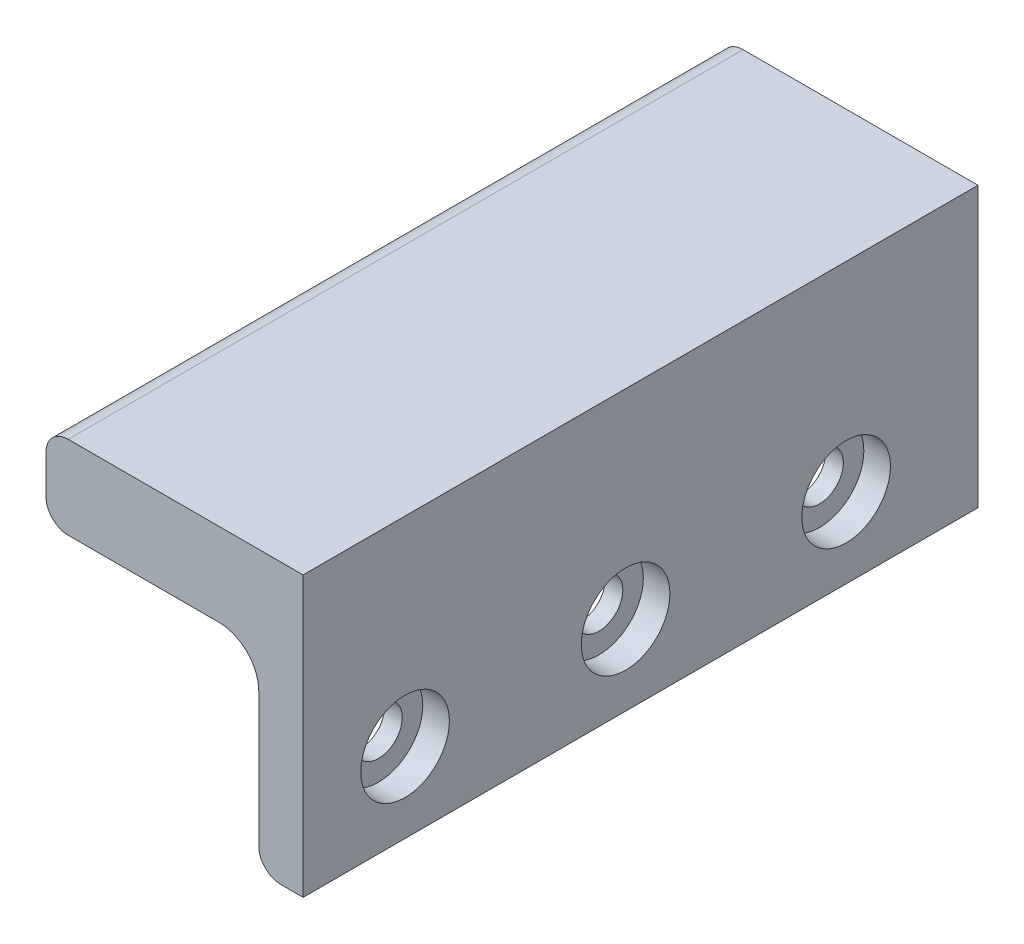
ISO-10303-21;
HEADER;
FILE_DESCRIPTION(('STEP AP214'),'2;1');
FILE_NAME('part.step','',(''),(''),'','','');
FILE_SCHEMA(('AUTOMOTIVE_DESIGN { 1 0 10303 214 1 1 1 1 }'));
ENDSEC;
DATA;
#1=APPLICATION_CONTEXT('core data for automotive mechanical design processes');
#2=APPLICATION_PROTOCOL_DEFINITION('international standard','automotive_design',2000,#1);
#3=PRODUCT_CONTEXT('',#1,'mechanical');
#4=PRODUCT('Part','Part','',(#3));
#5=PRODUCT_RELATED_PRODUCT_CATEGORY('part','',(#4));
#6=PRODUCT_DEFINITION_FORMATION('','',#4);
#7=PRODUCT_DEFINITION_CONTEXT('part definition',#1,'design');
#8=PRODUCT_DEFINITION('design','',#6,#7);
#9=PRODUCT_DEFINITION_SHAPE('','',#8);
#10=(LENGTH_UNIT() NAMED_UNIT(*) SI_UNIT(.MILLI.,.METRE.));
#11=(NAMED_UNIT(*) PLANE_ANGLE_UNIT() SI_UNIT($,.RADIAN.));
#12=(NAMED_UNIT(*) SI_UNIT($,.STERADIAN.) SOLID_ANGLE_UNIT());
#13=UNCERTAINTY_MEASURE_WITH_UNIT(LENGTH_MEASURE(1.E-05),#10,'distance_accuracy_value','');
#14=(GEOMETRIC_REPRESENTATION_CONTEXT(3) GLOBAL_UNCERTAINTY_ASSIGNED_CONTEXT((#13)) GLOBAL_UNIT_ASSIGNED_CONTEXT((#10,
#11,#12)) REPRESENTATION_CONTEXT('',''));
#15=CARTESIAN_POINT('',(0.,0.,0.));
#16=DIRECTION('',(0.,0.,1.));
#17=DIRECTION('',(1.,0.,0.));
#18=AXIS2_PLACEMENT_3D('',#15,#16,#17);
#19=CARTESIAN_POINT('',(15.6,-11.1,-60.9));
#20=DIRECTION('',(0.,0.,1.));
#21=DIRECTION('',(1.,0.,0.));
#22=AXIS2_PLACEMENT_3D('',#19,#20,#21);
#23=CYLINDRICAL_SURFACE('',#22,3.6);
#24=DIRECTION('',(0.,0.,-1.));
#25=VECTOR('',#24,1.);
#26=CARTESIAN_POINT('',(19.2,-11.1,-60.9));
#27=LINE('',#26,#25);
#28=CARTESIAN_POINT('',(19.2,-11.1,0.));
#29=VERTEX_POINT('',#28);
#30=CARTESIAN_POINT('',(19.2,-11.1,-60.9));
#31=VERTEX_POINT('',#30);
#32=EDGE_CURVE('E225',#29,#31,#27,.T.);
#33=ORIENTED_EDGE('',*,*,#32,.F.);
#34=CARTESIAN_POINT('',(15.6,-11.1,0.));
#35=DIRECTION('',(0.,0.,1.));
#36=DIRECTION('',(1.,0.,0.));
#37=AXIS2_PLACEMENT_3D('',#34,#35,#36);
#38=CIRCLE('',#37,3.6);
#39=CARTESIAN_POINT('',(15.6,-7.49999999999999,0.));
#40=VERTEX_POINT('',#39);
#41=EDGE_CURVE('E33',#29,#40,#38,.T.);
#42=ORIENTED_EDGE('',*,*,#41,.T.);
#43=DIRECTION('',(0.,0.,-1.));
#44=VECTOR('',#43,1.);
#45=CARTESIAN_POINT('',(15.6,-7.49999999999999,-60.9));
#46=LINE('',#45,#44);
#47=CARTESIAN_POINT('',(15.6,-7.49999999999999,-60.9));
#48=VERTEX_POINT('',#47);
#49=EDGE_CURVE('E228',#48,#40,#46,.F.);
#50=ORIENTED_EDGE('',*,*,#49,.F.);
#51=CARTESIAN_POINT('',(15.6,-11.1,-60.9));
#52=DIRECTION('',(0.,0.,1.));
#53=DIRECTION('',(1.,0.,0.));
#54=AXIS2_PLACEMENT_3D('',#51,#52,#53);
#55=CIRCLE('',#54,3.6);
#56=EDGE_CURVE('E11',#48,#31,#55,.F.);
#57=ORIENTED_EDGE('',*,*,#56,.T.);
#58=EDGE_LOOP('',(#33,#42,#50,#57));
#59=FACE_BOUND('',#58,.T.);
#60=ADVANCED_FACE('F26',(#59),#23,.F.);
#61=CARTESIAN_POINT('',(0.,0.,-60.9));
#62=DIRECTION('',(-1.,0.,0.));
#63=DIRECTION('',(0.,-1.,0.));
#64=AXIS2_PLACEMENT_3D('',#61,#62,#63);
#65=PLANE('',#64);
#66=DIRECTION('',(0.,-1.,0.));
#67=VECTOR('',#66,1.);
#68=CARTESIAN_POINT('',(0.,0.,0.));
#69=LINE('',#68,#67);
#70=CARTESIAN_POINT('',(0.,-2.,0.));
#71=VERTEX_POINT('',#70);
#72=CARTESIAN_POINT('',(0.,-5.5,0.));
#73=VERTEX_POINT('',#72);
#74=EDGE_CURVE('E154',#71,#73,#69,.T.);
#75=ORIENTED_EDGE('',*,*,#74,.F.);
#76=DIRECTION('',(0.,0.,1.));
#77=VECTOR('',#76,1.);
#78=CARTESIAN_POINT('',(0.,-2.,-60.9));
#79=LINE('',#78,#77);
#80=CARTESIAN_POINT('',(0.,-2.,-60.9));
#81=VERTEX_POINT('',#80);
#82=EDGE_CURVE('E209',#71,#81,#79,.F.);
#83=ORIENTED_EDGE('',*,*,#82,.T.);
#84=DIRECTION('',(0.,-1.,0.));
#85=VECTOR('',#84,1.);
#86=CARTESIAN_POINT('',(0.,0.,-60.9));
#87=LINE('',#86,#85);
#88=CARTESIAN_POINT('',(0.,-5.5,-60.9));
#89=VERTEX_POINT('',#88);
#90=EDGE_CURVE('E170',#81,#89,#87,.T.);
#91=ORIENTED_EDGE('',*,*,#90,.T.);
#92=DIRECTION('',(0.,0.,1.));
#93=VECTOR('',#92,1.);
#94=CARTESIAN_POINT('',(0.,-5.5,-60.9));
#95=LINE('',#94,#93);
#96=EDGE_CURVE('E206',#89,#73,#95,.T.);
#97=ORIENTED_EDGE('',*,*,#96,.T.);
#98=EDGE_LOOP('',(#75,#83,#91,#97));
#99=FACE_BOUND('',#98,.T.);
#100=ADVANCED_FACE('F241',(#99),#65,.T.);
#101=CARTESIAN_POINT('',(0.,0.,-60.9));
#102=DIRECTION('',(0.,1.,0.));
#103=DIRECTION('',(-1.,0.,0.));
#104=AXIS2_PLACEMENT_3D('',#101,#102,#103);
#105=PLANE('',#104);
#106=DIRECTION('',(-1.,0.,0.));
#107=VECTOR('',#106,1.);
#108=CARTESIAN_POINT('',(0.,0.,-60.9));
#109=LINE('',#108,#107);
#110=CARTESIAN_POINT('',(23.2,0.,-60.9));
#111=VERTEX_POINT('',#110);
#112=CARTESIAN_POINT('',(2.,0.,-60.9));
#113=VERTEX_POINT('',#112);
#114=EDGE_CURVE('E183',#111,#113,#109,.T.);
#115=ORIENTED_EDGE('',*,*,#114,.T.);
#116=DIRECTION('',(0.,0.,1.));
#117=VECTOR('',#116,1.);
#118=CARTESIAN_POINT('',(2.,0.,-60.9));
#119=LINE('',#118,#117);
#120=CARTESIAN_POINT('',(2.,0.,0.));
#121=VERTEX_POINT('',#120);
#122=EDGE_CURVE('E189',#113,#121,#119,.T.);
#123=ORIENTED_EDGE('',*,*,#122,.T.);
#124=DIRECTION('',(-1.,0.,0.));
#125=VECTOR('',#124,1.);
#126=CARTESIAN_POINT('',(0.,0.,0.));
#127=LINE('',#126,#125);
#128=CARTESIAN_POINT('',(23.2,0.,0.));
#129=VERTEX_POINT('',#128);
#130=EDGE_CURVE('E167',#129,#121,#127,.T.);
#131=ORIENTED_EDGE('',*,*,#130,.F.);
#132=DIRECTION('',(0.,0.,1.));
#133=VECTOR('',#132,1.);
#134=CARTESIAN_POINT('',(23.2,0.,-60.9));
#135=LINE('',#134,#133);
#136=EDGE_CURVE('E187',#111,#129,#135,.T.);
#137=ORIENTED_EDGE('',*,*,#136,.F.);
#138=EDGE_LOOP('',(#115,#123,#131,#137));
#139=FACE_BOUND('',#138,.T.);
#140=ADVANCED_FACE('F252',(#139),#105,.T.);
#141=CARTESIAN_POINT('',(23.2,0.,-60.9));
#142=DIRECTION('',(1.,0.,0.));
#143=DIRECTION('',(0.,1.,0.));
#144=AXIS2_PLACEMENT_3D('',#141,#142,#143);
#145=PLANE('',#144);
#146=CARTESIAN_POINT('',(23.2,-18.,-9.2));
#147=DIRECTION('',(1.,0.,0.));
#148=DIRECTION('',(0.,0.,-1.));
#149=AXIS2_PLACEMENT_3D('',#146,#147,#148);
#150=CIRCLE('',#149,4.);
#151=CARTESIAN_POINT('',(23.2,-18.,-13.2));
#152=VERTEX_POINT('',#151);
#153=EDGE_CURVE('E124',#152,#152,#150,.T.);
#154=ORIENTED_EDGE('',*,*,#153,.F.);
#155=EDGE_LOOP('',(#154));
#156=FACE_BOUND('',#155,.T.);
#157=CARTESIAN_POINT('',(23.2,-18.,-29.1));
#158=DIRECTION('',(1.,0.,0.));
#159=DIRECTION('',(0.,0.,-1.));
#160=AXIS2_PLACEMENT_3D('',#157,#158,#159);
#161=CIRCLE('',#160,4.);
#162=CARTESIAN_POINT('',(23.2,-18.,-33.1));
#163=VERTEX_POINT('',#162);
#164=EDGE_CURVE('E134',#163,#163,#161,.T.);
#165=ORIENTED_EDGE('',*,*,#164,.F.);
#166=EDGE_LOOP('',(#165));
#167=FACE_BOUND('',#166,.T.);
#168=CARTESIAN_POINT('',(23.2,-18.,-49.));
#169=DIRECTION('',(1.,0.,0.));
#170=DIRECTION('',(0.,0.,-1.));
#171=AXIS2_PLACEMENT_3D('',#168,#169,#170);
#172=CIRCLE('',#171,4.);
#173=CARTESIAN_POINT('',(23.2,-18.,-53.));
#174=VERTEX_POINT('',#173);
#175=EDGE_CURVE('E144',#174,#174,#172,.T.);
#176=ORIENTED_EDGE('',*,*,#175,.F.);
#177=EDGE_LOOP('',(#176));
#178=FACE_BOUND('',#177,.T.);
#179=DIRECTION('',(0.,1.,0.));
#180=VECTOR('',#179,1.);
#181=CARTESIAN_POINT('',(23.2,0.,0.));
#182=LINE('',#181,#180);
#183=CARTESIAN_POINT('',(23.2,-25.2,0.));
#184=VERTEX_POINT('',#183);
#185=EDGE_CURVE('E164',#184,#129,#182,.T.);
#186=ORIENTED_EDGE('',*,*,#185,.F.);
#187=DIRECTION('',(0.,0.,1.));
#188=VECTOR('',#187,1.);
#189=CARTESIAN_POINT('',(23.2,-25.2,-60.9));
#190=LINE('',#189,#188);
#191=CARTESIAN_POINT('',(23.2,-25.2,-60.9));
#192=VERTEX_POINT('',#191);
#193=EDGE_CURVE('E186',#192,#184,#190,.T.);
#194=ORIENTED_EDGE('',*,*,#193,.F.);
#195=DIRECTION('',(0.,1.,0.));
#196=VECTOR('',#195,1.);
#197=CARTESIAN_POINT('',(23.2,0.,-60.9));
#198=LINE('',#197,#196);
#199=EDGE_CURVE('E180',#192,#111,#198,.T.);
#200=ORIENTED_EDGE('',*,*,#199,.T.);
#201=ORIENTED_EDGE('',*,*,#136,.T.);
#202=EDGE_LOOP('',(#186,#194,#200,#201));
#203=FACE_BOUND('',#202,.T.);
#204=ADVANCED_FACE('F257',(#156,#167,#178,#203),#145,.T.);
#205=CARTESIAN_POINT('',(19.2,-25.2,-60.9));
#206=DIRECTION('',(0.,-1.,0.));
#207=DIRECTION('',(1.,0.,0.));
#208=AXIS2_PLACEMENT_3D('',#205,#206,#207);
#209=PLANE('',#208);
#210=DIRECTION('',(1.,0.,0.));
#211=VECTOR('',#210,1.);
#212=CARTESIAN_POINT('',(19.2,-25.2,0.));
#213=LINE('',#212,#211);
#214=CARTESIAN_POINT('',(21.2,-25.2,0.));
#215=VERTEX_POINT('',#214);
#216=EDGE_CURVE('E162',#215,#184,#213,.T.);
#217=ORIENTED_EDGE('',*,*,#216,.F.);
#218=DIRECTION('',(0.,0.,1.));
#219=VECTOR('',#218,1.);
#220=CARTESIAN_POINT('',(21.2,-25.2,-60.9));
#221=LINE('',#220,#219);
#222=CARTESIAN_POINT('',(21.2,-25.2,-60.9));
#223=VERTEX_POINT('',#222);
#224=EDGE_CURVE('E223',#215,#223,#221,.F.);
#225=ORIENTED_EDGE('',*,*,#224,.T.);
#226=DIRECTION('',(1.,0.,0.));
#227=VECTOR('',#226,1.);
#228=CARTESIAN_POINT('',(19.2,-25.2,-60.9));
#229=LINE('',#228,#227);
#230=EDGE_CURVE('E178',#223,#192,#229,.T.);
#231=ORIENTED_EDGE('',*,*,#230,.T.);
#232=ORIENTED_EDGE('',*,*,#193,.T.);
#233=EDGE_LOOP('',(#217,#225,#231,#232));
#234=FACE_BOUND('',#233,.T.);
#235=ADVANCED_FACE('F286',(#234),#209,.T.);
#236=CARTESIAN_POINT('',(19.2,-7.49999999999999,-60.9));
#237=DIRECTION('',(-1.,0.,0.));
#238=DIRECTION('',(0.,-1.,0.));
#239=AXIS2_PLACEMENT_3D('',#236,#237,#238);
#240=PLANE('',#239);
#241=CARTESIAN_POINT('',(19.2,-18.,-9.2));
#242=DIRECTION('',(-1.,0.,0.));
#243=DIRECTION('',(0.,-1.,0.));
#244=AXIS2_PLACEMENT_3D('',#241,#242,#243);
#245=CIRCLE('',#244,2.15);
#246=CARTESIAN_POINT('',(19.2,-20.15,-9.2));
#247=VERTEX_POINT('',#246);
#248=EDGE_CURVE('E133',#247,#247,#245,.T.);
#249=ORIENTED_EDGE('',*,*,#248,.F.);
#250=EDGE_LOOP('',(#249));
#251=FACE_BOUND('',#250,.T.);
#252=CARTESIAN_POINT('',(19.2,-18.,-29.1));
#253=DIRECTION('',(-1.,0.,0.));
#254=DIRECTION('',(0.,-1.,0.));
#255=AXIS2_PLACEMENT_3D('',#252,#253,#254);
#256=CIRCLE('',#255,2.15);
#257=CARTESIAN_POINT('',(19.2,-20.15,-29.1));
#258=VERTEX_POINT('',#257);
#259=EDGE_CURVE('E143',#258,#258,#256,.T.);
#260=ORIENTED_EDGE('',*,*,#259,.F.);
#261=EDGE_LOOP('',(#260));
#262=FACE_BOUND('',#261,.T.);
#263=CARTESIAN_POINT('',(19.2,-18.,-49.));
#264=DIRECTION('',(-1.,0.,0.));
#265=DIRECTION('',(0.,-1.,0.));
#266=AXIS2_PLACEMENT_3D('',#263,#264,#265);
#267=CIRCLE('',#266,2.15);
#268=CARTESIAN_POINT('',(19.2,-20.15,-49.));
#269=VERTEX_POINT('',#268);
#270=EDGE_CURVE('E153',#269,#269,#267,.T.);
#271=ORIENTED_EDGE('',*,*,#270,.F.);
#272=EDGE_LOOP('',(#271));
#273=FACE_BOUND('',#272,.T.);
#274=DIRECTION('',(0.,-1.,0.));
#275=VECTOR('',#274,1.);
#276=CARTESIAN_POINT('',(19.2,-7.49999999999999,0.));
#277=LINE('',#276,#275);
#278=CARTESIAN_POINT('',(19.2,-23.2,0.));
#279=VERTEX_POINT('',#278);
#280=EDGE_CURVE('E160',#29,#279,#277,.T.);
#281=ORIENTED_EDGE('',*,*,#280,.F.);
#282=ORIENTED_EDGE('',*,*,#32,.T.);
#283=DIRECTION('',(0.,-1.,0.));
#284=VECTOR('',#283,1.);
#285=CARTESIAN_POINT('',(19.2,-7.49999999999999,-60.9));
#286=LINE('',#285,#284);
#287=CARTESIAN_POINT('',(19.2,-23.2,-60.9));
#288=VERTEX_POINT('',#287);
#289=EDGE_CURVE('E176',#31,#288,#286,.T.);
#290=ORIENTED_EDGE('',*,*,#289,.T.);
#291=DIRECTION('',(0.,0.,1.));
#292=VECTOR('',#291,1.);
#293=CARTESIAN_POINT('',(19.2,-23.2,-60.9));
#294=LINE('',#293,#292);
#295=EDGE_CURVE('E220',#288,#279,#294,.T.);
#296=ORIENTED_EDGE('',*,*,#295,.T.);
#297=EDGE_LOOP('',(#281,#282,#290,#296));
#298=FACE_BOUND('',#297,.T.);
#299=ADVANCED_FACE('F269',(#251,#262,#273,#298),#240,.T.);
#300=CARTESIAN_POINT('',(0.,-7.5,-60.9));
#301=DIRECTION('',(0.,-1.,0.));
#302=DIRECTION('',(1.,0.,0.));
#303=AXIS2_PLACEMENT_3D('',#300,#301,#302);
#304=PLANE('',#303);
#305=CARTESIAN_POINT('',(10.,-7.5,-45.9));
#306=DIRECTION('',(0.,-1.,0.));
#307=DIRECTION('',(0.,0.,-1.));
#308=AXIS2_PLACEMENT_3D('',#305,#306,#307);
#309=CIRCLE('',#308,2.5);
#310=CARTESIAN_POINT('',(10.,-7.5,-48.4));
#311=VERTEX_POINT('',#310);
#312=EDGE_CURVE('E113',#311,#311,#309,.T.);
#313=ORIENTED_EDGE('',*,*,#312,.F.);
#314=EDGE_LOOP('',(#313));
#315=FACE_BOUND('',#314,.T.);
#316=CARTESIAN_POINT('',(10.,-7.5,-19.9));
#317=DIRECTION('',(0.,-1.,0.));
#318=DIRECTION('',(0.,0.,-1.));
#319=AXIS2_PLACEMENT_3D('',#316,#317,#318);
#320=CIRCLE('',#319,2.5);
#321=CARTESIAN_POINT('',(10.,-7.5,-22.4));
#322=VERTEX_POINT('',#321);
#323=EDGE_CURVE('E121',#322,#322,#320,.T.);
#324=ORIENTED_EDGE('',*,*,#323,.F.);
#325=EDGE_LOOP('',(#324));
#326=FACE_BOUND('',#325,.T.);
#327=DIRECTION('',(1.,0.,0.));
#328=VECTOR('',#327,1.);
#329=CARTESIAN_POINT('',(0.,-7.5,-60.9));
#330=LINE('',#329,#328);
#331=CARTESIAN_POINT('',(2.,-7.5,-60.9));
#332=VERTEX_POINT('',#331);
#333=EDGE_CURVE('E173',#332,#48,#330,.T.);
#334=ORIENTED_EDGE('',*,*,#333,.T.);
#335=ORIENTED_EDGE('',*,*,#49,.T.);
#336=DIRECTION('',(1.,0.,0.));
#337=VECTOR('',#336,1.);
#338=CARTESIAN_POINT('',(0.,-7.5,0.));
#339=LINE('',#338,#337);
#340=CARTESIAN_POINT('',(2.,-7.5,0.));
#341=VERTEX_POINT('',#340);
#342=EDGE_CURVE('E157',#341,#40,#339,.T.);
#343=ORIENTED_EDGE('',*,*,#342,.F.);
#344=DIRECTION('',(0.,0.,1.));
#345=VECTOR('',#344,1.);
#346=CARTESIAN_POINT('',(2.,-7.5,-60.9));
#347=LINE('',#346,#345);
#348=EDGE_CURVE('E218',#341,#332,#347,.F.);
#349=ORIENTED_EDGE('',*,*,#348,.T.);
#350=EDGE_LOOP('',(#334,#335,#343,#349));
#351=FACE_BOUND('',#350,.T.);
#352=ADVANCED_FACE('F231',(#315,#326,#351),#304,.T.);
#353=CARTESIAN_POINT('',(0.,0.,-60.9));
#354=DIRECTION('',(0.,0.,1.));
#355=DIRECTION('',(1.,0.,0.));
#356=AXIS2_PLACEMENT_3D('',#353,#354,#355);
#357=PLANE('',#356);
#358=ORIENTED_EDGE('',*,*,#90,.F.);
#359=CARTESIAN_POINT('',(2.,-2.,-60.9));
#360=DIRECTION('',(0.,0.,1.));
#361=DIRECTION('',(1.,0.,0.));
#362=AXIS2_PLACEMENT_3D('',#359,#360,#361);
#363=CIRCLE('',#362,2.);
#364=EDGE_CURVE('E216',#81,#113,#363,.F.);
#365=ORIENTED_EDGE('',*,*,#364,.T.);
#366=ORIENTED_EDGE('',*,*,#114,.F.);
#367=ORIENTED_EDGE('',*,*,#199,.F.);
#368=ORIENTED_EDGE('',*,*,#230,.F.);
#369=CARTESIAN_POINT('',(21.2,-23.2,-60.9));
#370=DIRECTION('',(0.,0.,1.));
#371=DIRECTION('',(1.,0.,0.));
#372=AXIS2_PLACEMENT_3D('',#369,#370,#371);
#373=CIRCLE('',#372,2.);
#374=EDGE_CURVE('E211',#223,#288,#373,.F.);
#375=ORIENTED_EDGE('',*,*,#374,.T.);
#376=ORIENTED_EDGE('',*,*,#289,.F.);
#377=ORIENTED_EDGE('',*,*,#56,.F.);
#378=ORIENTED_EDGE('',*,*,#333,.F.);
#379=CARTESIAN_POINT('',(2.,-5.5,-60.9));
#380=DIRECTION('',(0.,0.,1.));
#381=DIRECTION('',(1.,0.,0.));
#382=AXIS2_PLACEMENT_3D('',#379,#380,#381);
#383=CIRCLE('',#382,2.);
#384=EDGE_CURVE('E214',#332,#89,#383,.F.);
#385=ORIENTED_EDGE('',*,*,#384,.T.);
#386=EDGE_LOOP('',(#358,#365,#366,#367,#368,#375,#376,#377,#378,#385));
#387=FACE_BOUND('',#386,.T.);
#388=ADVANCED_FACE('F245',(#387),#357,.F.);
#389=CARTESIAN_POINT('',(0.,0.,0.));
#390=DIRECTION('',(0.,0.,1.));
#391=DIRECTION('',(1.,0.,0.));
#392=AXIS2_PLACEMENT_3D('',#389,#390,#391);
#393=PLANE('',#392);
#394=ORIENTED_EDGE('',*,*,#41,.F.);
#395=ORIENTED_EDGE('',*,*,#280,.T.);
#396=CARTESIAN_POINT('',(21.2,-23.2,0.));
#397=DIRECTION('',(0.,0.,1.));
#398=DIRECTION('',(1.,0.,0.));
#399=AXIS2_PLACEMENT_3D('',#396,#397,#398);
#400=CIRCLE('',#399,2.);
#401=EDGE_CURVE('E200',#279,#215,#400,.T.);
#402=ORIENTED_EDGE('',*,*,#401,.T.);
#403=ORIENTED_EDGE('',*,*,#216,.T.);
#404=ORIENTED_EDGE('',*,*,#185,.T.);
#405=ORIENTED_EDGE('',*,*,#130,.T.);
#406=CARTESIAN_POINT('',(2.,-2.,0.));
#407=DIRECTION('',(0.,0.,1.));
#408=DIRECTION('',(1.,0.,0.));
#409=AXIS2_PLACEMENT_3D('',#406,#407,#408);
#410=CIRCLE('',#409,2.);
#411=EDGE_CURVE('E204',#121,#71,#410,.T.);
#412=ORIENTED_EDGE('',*,*,#411,.T.);
#413=ORIENTED_EDGE('',*,*,#74,.T.);
#414=CARTESIAN_POINT('',(2.,-5.5,0.));
#415=DIRECTION('',(0.,0.,1.));
#416=DIRECTION('',(1.,0.,0.));
#417=AXIS2_PLACEMENT_3D('',#414,#415,#416);
#418=CIRCLE('',#417,2.);
#419=EDGE_CURVE('E202',#73,#341,#418,.T.);
#420=ORIENTED_EDGE('',*,*,#419,.T.);
#421=ORIENTED_EDGE('',*,*,#342,.T.);
#422=EDGE_LOOP('',(#394,#395,#402,#403,#404,#405,#412,#413,#420,#421));
#423=FACE_BOUND('',#422,.T.);
#424=ADVANCED_FACE('F234',(#423),#393,.T.);
#425=CARTESIAN_POINT('',(23.2,-18.,-49.));
#426=DIRECTION('',(1.,0.,0.));
#427=DIRECTION('',(0.,0.,-1.));
#428=AXIS2_PLACEMENT_3D('',#425,#426,#427);
#429=CYLINDRICAL_SURFACE('',#428,2.15);
#430=ORIENTED_EDGE('',*,*,#270,.T.);
#431=EDGE_LOOP('',(#430));
#432=FACE_BOUND('',#431,.T.);
#433=CARTESIAN_POINT('',(20.8,-18.,-49.));
#434=DIRECTION('',(1.,0.,0.));
#435=DIRECTION('',(0.,0.,-1.));
#436=AXIS2_PLACEMENT_3D('',#433,#434,#435);
#437=CIRCLE('',#436,2.15);
#438=CARTESIAN_POINT('',(20.8,-18.,-51.15));
#439=VERTEX_POINT('',#438);
#440=EDGE_CURVE('E150',#439,#439,#437,.T.);
#441=ORIENTED_EDGE('',*,*,#440,.T.);
#442=EDGE_LOOP('',(#441));
#443=FACE_BOUND('',#442,.T.);
#444=ADVANCED_FACE('F297',(#432,#443),#429,.F.);
#445=CARTESIAN_POINT('',(20.8,-15.85,-49.));
#446=DIRECTION('',(-1.,0.,0.));
#447=DIRECTION('',(0.,0.,1.));
#448=AXIS2_PLACEMENT_3D('',#445,#446,#447);
#449=PLANE('',#448);
#450=ORIENTED_EDGE('',*,*,#440,.F.);
#451=EDGE_LOOP('',(#450));
#452=FACE_BOUND('',#451,.T.);
#453=CARTESIAN_POINT('',(20.8,-18.,-49.));
#454=DIRECTION('',(1.,0.,0.));
#455=DIRECTION('',(0.,0.,-1.));
#456=AXIS2_PLACEMENT_3D('',#453,#454,#455);
#457=CIRCLE('',#456,4.);
#458=CARTESIAN_POINT('',(20.8,-18.,-53.));
#459=VERTEX_POINT('',#458);
#460=EDGE_CURVE('E147',#459,#459,#457,.T.);
#461=ORIENTED_EDGE('',*,*,#460,.T.);
#462=EDGE_LOOP('',(#461));
#463=FACE_BOUND('',#462,.T.);
#464=ADVANCED_FACE('F300',(#452,#463),#449,.F.);
#465=CARTESIAN_POINT('',(23.2,-18.,-49.));
#466=DIRECTION('',(1.,0.,0.));
#467=DIRECTION('',(0.,0.,-1.));
#468=AXIS2_PLACEMENT_3D('',#465,#466,#467);
#469=CYLINDRICAL_SURFACE('',#468,4.);
#470=ORIENTED_EDGE('',*,*,#460,.F.);
#471=EDGE_LOOP('',(#470));
#472=FACE_BOUND('',#471,.T.);
#473=ORIENTED_EDGE('',*,*,#175,.T.);
#474=EDGE_LOOP('',(#473));
#475=FACE_BOUND('',#474,.T.);
#476=ADVANCED_FACE('F304',(#472,#475),#469,.F.);
#477=CARTESIAN_POINT('',(23.2,-18.,-29.1));
#478=DIRECTION('',(1.,0.,0.));
#479=DIRECTION('',(0.,0.,-1.));
#480=AXIS2_PLACEMENT_3D('',#477,#478,#479);
#481=CYLINDRICAL_SURFACE('',#480,2.15);
#482=ORIENTED_EDGE('',*,*,#259,.T.);
#483=EDGE_LOOP('',(#482));
#484=FACE_BOUND('',#483,.T.);
#485=CARTESIAN_POINT('',(20.8,-18.,-29.1));
#486=DIRECTION('',(1.,0.,0.));
#487=DIRECTION('',(0.,0.,-1.));
#488=AXIS2_PLACEMENT_3D('',#485,#486,#487);
#489=CIRCLE('',#488,2.15);
#490=CARTESIAN_POINT('',(20.8,-18.,-31.25));
#491=VERTEX_POINT('',#490);
#492=EDGE_CURVE('E140',#491,#491,#489,.T.);
#493=ORIENTED_EDGE('',*,*,#492,.T.);
#494=EDGE_LOOP('',(#493));
#495=FACE_BOUND('',#494,.T.);
#496=ADVANCED_FACE('F308',(#484,#495),#481,.F.);
#497=CARTESIAN_POINT('',(20.8,-15.85,-29.1));
#498=DIRECTION('',(-1.,0.,0.));
#499=DIRECTION('',(0.,0.,1.));
#500=AXIS2_PLACEMENT_3D('',#497,#498,#499);
#501=PLANE('',#500);
#502=ORIENTED_EDGE('',*,*,#492,.F.);
#503=EDGE_LOOP('',(#502));
#504=FACE_BOUND('',#503,.T.);
#505=CARTESIAN_POINT('',(20.8,-18.,-29.1));
#506=DIRECTION('',(1.,0.,0.));
#507=DIRECTION('',(0.,0.,-1.));
#508=AXIS2_PLACEMENT_3D('',#505,#506,#507);
#509=CIRCLE('',#508,4.);
#510=CARTESIAN_POINT('',(20.8,-18.,-33.1));
#511=VERTEX_POINT('',#510);
#512=EDGE_CURVE('E137',#511,#511,#509,.T.);
#513=ORIENTED_EDGE('',*,*,#512,.T.);
#514=EDGE_LOOP('',(#513));
#515=FACE_BOUND('',#514,.T.);
#516=ADVANCED_FACE('F312',(#504,#515),#501,.F.);
#517=CARTESIAN_POINT('',(23.2,-18.,-29.1));
#518=DIRECTION('',(1.,0.,0.));
#519=DIRECTION('',(0.,0.,-1.));
#520=AXIS2_PLACEMENT_3D('',#517,#518,#519);
#521=CYLINDRICAL_SURFACE('',#520,4.);
#522=ORIENTED_EDGE('',*,*,#512,.F.);
#523=EDGE_LOOP('',(#522));
#524=FACE_BOUND('',#523,.T.);
#525=ORIENTED_EDGE('',*,*,#164,.T.);
#526=EDGE_LOOP('',(#525));
#527=FACE_BOUND('',#526,.T.);
#528=ADVANCED_FACE('F316',(#524,#527),#521,.F.);
#529=CARTESIAN_POINT('',(23.2,-18.,-9.2));
#530=DIRECTION('',(1.,0.,0.));
#531=DIRECTION('',(0.,0.,-1.));
#532=AXIS2_PLACEMENT_3D('',#529,#530,#531);
#533=CYLINDRICAL_SURFACE('',#532,2.15);
#534=ORIENTED_EDGE('',*,*,#248,.T.);
#535=EDGE_LOOP('',(#534));
#536=FACE_BOUND('',#535,.T.);
#537=CARTESIAN_POINT('',(20.8,-18.,-9.2));
#538=DIRECTION('',(1.,0.,0.));
#539=DIRECTION('',(0.,0.,-1.));
#540=AXIS2_PLACEMENT_3D('',#537,#538,#539);
#541=CIRCLE('',#540,2.15);
#542=CARTESIAN_POINT('',(20.8,-18.,-11.35));
#543=VERTEX_POINT('',#542);
#544=EDGE_CURVE('E130',#543,#543,#541,.T.);
#545=ORIENTED_EDGE('',*,*,#544,.T.);
#546=EDGE_LOOP('',(#545));
#547=FACE_BOUND('',#546,.T.);
#548=ADVANCED_FACE('F320',(#536,#547),#533,.F.);
#549=CARTESIAN_POINT('',(20.8,-15.85,-9.2));
#550=DIRECTION('',(-1.,0.,0.));
#551=DIRECTION('',(0.,0.,1.));
#552=AXIS2_PLACEMENT_3D('',#549,#550,#551);
#553=PLANE('',#552);
#554=ORIENTED_EDGE('',*,*,#544,.F.);
#555=EDGE_LOOP('',(#554));
#556=FACE_BOUND('',#555,.T.);
#557=CARTESIAN_POINT('',(20.8,-18.,-9.2));
#558=DIRECTION('',(1.,0.,0.));
#559=DIRECTION('',(0.,0.,-1.));
#560=AXIS2_PLACEMENT_3D('',#557,#558,#559);
#561=CIRCLE('',#560,4.);
#562=CARTESIAN_POINT('',(20.8,-18.,-13.2));
#563=VERTEX_POINT('',#562);
#564=EDGE_CURVE('E127',#563,#563,#561,.T.);
#565=ORIENTED_EDGE('',*,*,#564,.T.);
#566=EDGE_LOOP('',(#565));
#567=FACE_BOUND('',#566,.T.);
#568=ADVANCED_FACE('F324',(#556,#567),#553,.F.);
#569=CARTESIAN_POINT('',(23.2,-18.,-9.2));
#570=DIRECTION('',(1.,0.,0.));
#571=DIRECTION('',(0.,0.,-1.));
#572=AXIS2_PLACEMENT_3D('',#569,#570,#571);
#573=CYLINDRICAL_SURFACE('',#572,4.);
#574=ORIENTED_EDGE('',*,*,#564,.F.);
#575=EDGE_LOOP('',(#574));
#576=FACE_BOUND('',#575,.T.);
#577=ORIENTED_EDGE('',*,*,#153,.T.);
#578=EDGE_LOOP('',(#577));
#579=FACE_BOUND('',#578,.T.);
#580=ADVANCED_FACE('F328',(#576,#579),#573,.F.);
#581=CARTESIAN_POINT('',(2.,-2.,-60.9));
#582=DIRECTION('',(0.,0.,1.));
#583=DIRECTION('',(1.,0.,0.));
#584=AXIS2_PLACEMENT_3D('',#581,#582,#583);
#585=CYLINDRICAL_SURFACE('',#584,2.);
#586=ORIENTED_EDGE('',*,*,#364,.F.);
#587=ORIENTED_EDGE('',*,*,#82,.F.);
#588=ORIENTED_EDGE('',*,*,#411,.F.);
#589=ORIENTED_EDGE('',*,*,#122,.F.);
#590=EDGE_LOOP('',(#586,#587,#588,#589));
#591=FACE_BOUND('',#590,.T.);
#592=ADVANCED_FACE('F249',(#591),#585,.T.);
#593=CARTESIAN_POINT('',(2.,-5.5,-60.9));
#594=DIRECTION('',(0.,0.,1.));
#595=DIRECTION('',(1.,0.,0.));
#596=AXIS2_PLACEMENT_3D('',#593,#594,#595);
#597=CYLINDRICAL_SURFACE('',#596,2.);
#598=ORIENTED_EDGE('',*,*,#384,.F.);
#599=ORIENTED_EDGE('',*,*,#348,.F.);
#600=ORIENTED_EDGE('',*,*,#419,.F.);
#601=ORIENTED_EDGE('',*,*,#96,.F.);
#602=EDGE_LOOP('',(#598,#599,#600,#601));
#603=FACE_BOUND('',#602,.T.);
#604=ADVANCED_FACE('F239',(#603),#597,.T.);
#605=CARTESIAN_POINT('',(21.2,-23.2,-60.9));
#606=DIRECTION('',(0.,0.,1.));
#607=DIRECTION('',(1.,0.,0.));
#608=AXIS2_PLACEMENT_3D('',#605,#606,#607);
#609=CYLINDRICAL_SURFACE('',#608,2.);
#610=ORIENTED_EDGE('',*,*,#374,.F.);
#611=ORIENTED_EDGE('',*,*,#224,.F.);
#612=ORIENTED_EDGE('',*,*,#401,.F.);
#613=ORIENTED_EDGE('',*,*,#295,.F.);
#614=EDGE_LOOP('',(#610,#611,#612,#613));
#615=FACE_BOUND('',#614,.T.);
#616=ADVANCED_FACE('F265',(#615),#609,.T.);
#617=CARTESIAN_POINT('',(10.,-7.5,-19.9));
#618=DIRECTION('',(0.,-1.,0.));
#619=DIRECTION('',(0.,0.,-1.));
#620=AXIS2_PLACEMENT_3D('',#617,#618,#619);
#621=CYLINDRICAL_SURFACE('',#620,2.5);
#622=CARTESIAN_POINT('',(10.,-2.5,-19.9));
#623=DIRECTION('',(0.,-1.,0.));
#624=DIRECTION('',(0.,0.,-1.));
#625=AXIS2_PLACEMENT_3D('',#622,#623,#624);
#626=CIRCLE('',#625,2.5);
#627=CARTESIAN_POINT('',(10.,-2.5,-22.4));
#628=VERTEX_POINT('',#627);
#629=EDGE_CURVE('E116',#628,#628,#626,.T.);
#630=ORIENTED_EDGE('',*,*,#629,.F.);
#631=EDGE_LOOP('',(#630));
#632=FACE_BOUND('',#631,.T.);
#633=ORIENTED_EDGE('',*,*,#323,.T.);
#634=EDGE_LOOP('',(#633));
#635=FACE_BOUND('',#634,.T.);
#636=ADVANCED_FACE('F337',(#632,#635),#621,.F.);
#637=CARTESIAN_POINT('',(10.,-2.5,-19.9));
#638=DIRECTION('',(0.,-1.,0.));
#639=DIRECTION('',(0.,0.,-1.));
#640=AXIS2_PLACEMENT_3D('',#637,#638,#639);
#641=CONICAL_SURFACE('',#640,2.5,1.02974425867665);
#642=CARTESIAN_POINT('',(10.,-0.997848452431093,-19.9));
#643=VERTEX_POINT('',#642);
#644=VERTEX_LOOP('',#643);
#645=FACE_BOUND('',#644,.T.);
#646=ORIENTED_EDGE('',*,*,#629,.T.);
#647=EDGE_LOOP('',(#646));
#648=FACE_BOUND('',#647,.T.);
#649=ADVANCED_FACE('F340',(#645,#648),#641,.F.);
#650=CARTESIAN_POINT('',(10.,-7.5,-45.9));
#651=DIRECTION('',(0.,-1.,0.));
#652=DIRECTION('',(0.,0.,-1.));
#653=AXIS2_PLACEMENT_3D('',#650,#651,#652);
#654=CYLINDRICAL_SURFACE('',#653,2.5);
#655=CARTESIAN_POINT('',(10.,-2.5,-45.9));
#656=DIRECTION('',(0.,-1.,0.));
#657=DIRECTION('',(0.,0.,-1.));
#658=AXIS2_PLACEMENT_3D('',#655,#656,#657);
#659=CIRCLE('',#658,2.5);
#660=CARTESIAN_POINT('',(10.,-2.5,-48.4));
#661=VERTEX_POINT('',#660);
#662=EDGE_CURVE('E111',#661,#661,#659,.T.);
#663=ORIENTED_EDGE('',*,*,#662,.F.);
#664=EDGE_LOOP('',(#663));
#665=FACE_BOUND('',#664,.T.);
#666=ORIENTED_EDGE('',*,*,#312,.T.);
#667=EDGE_LOOP('',(#666));
#668=FACE_BOUND('',#667,.T.);
#669=ADVANCED_FACE('F107',(#665,#668),#654,.F.);
#670=CARTESIAN_POINT('',(10.,-2.5,-45.9));
#671=DIRECTION('',(0.,-1.,0.));
#672=DIRECTION('',(0.,0.,-1.));
#673=AXIS2_PLACEMENT_3D('',#670,#671,#672);
#674=CONICAL_SURFACE('',#673,2.5,1.02974425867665);
#675=CARTESIAN_POINT('',(10.,-0.997848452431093,-45.9));
#676=VERTEX_POINT('',#675);
#677=VERTEX_LOOP('',#676);
#678=FACE_BOUND('',#677,.T.);
#679=ORIENTED_EDGE('',*,*,#662,.T.);
#680=EDGE_LOOP('',(#679));
#681=FACE_BOUND('',#680,.T.);
#682=ADVANCED_FACE('F104',(#678,#681),#674,.F.);
#683=CLOSED_SHELL('',(#60,#100,#140,#204,#235,#299,#352,#388,#424,#444,#464,#476,#496,#516,#528,
#548,#568,#580,#592,#604,#616,#636,#649,#669,#682));
#684=MANIFOLD_SOLID_BREP('B2',#683);
#685=ADVANCED_BREP_SHAPE_REPRESENTATION('',(#18,#684),#14);
#686=SHAPE_DEFINITION_REPRESENTATION(#9,#685);
ENDSEC;
END-ISO-10303-21;
